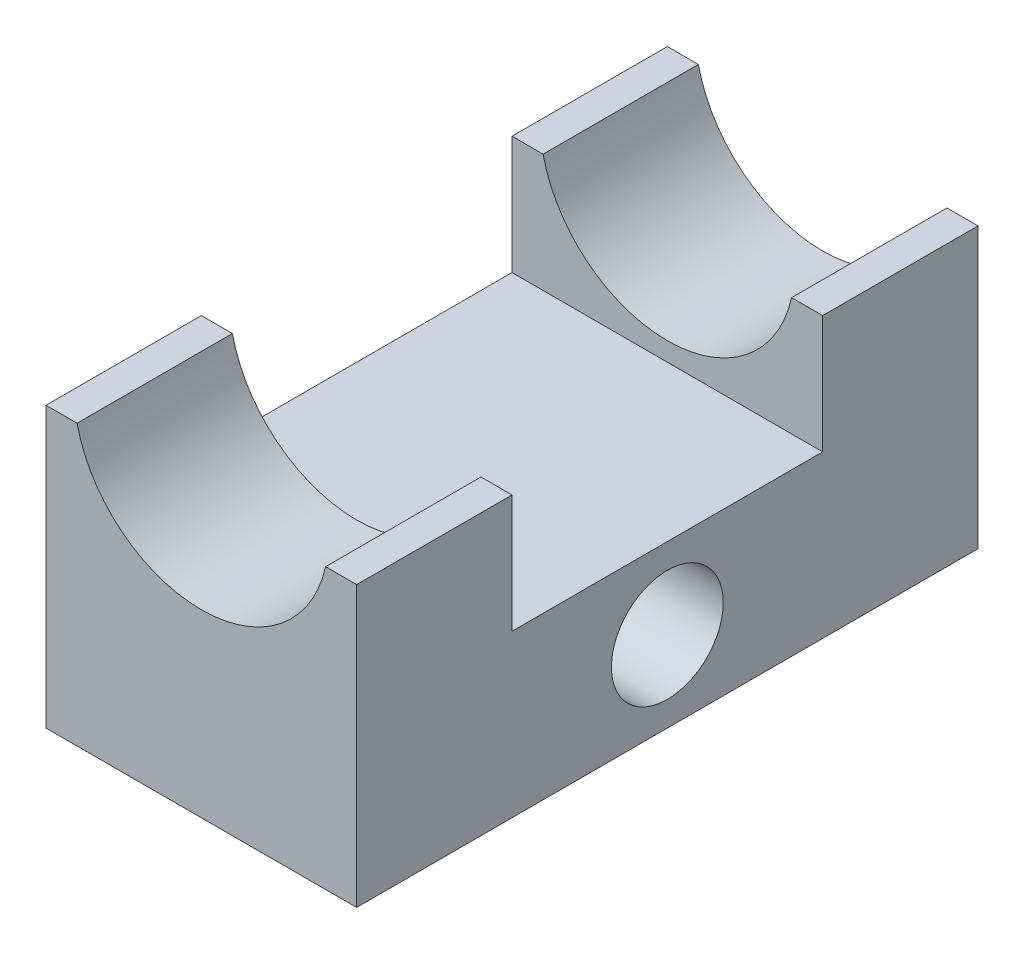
ISO-10303-21;
HEADER;
FILE_DESCRIPTION(('STEP AP214'),'2;1');
FILE_NAME('part.step','',(''),(''),'','','');
FILE_SCHEMA(('AUTOMOTIVE_DESIGN { 1 0 10303 214 1 1 1 1 }'));
ENDSEC;
DATA;
#1=APPLICATION_CONTEXT('core data for automotive mechanical design processes');
#2=APPLICATION_PROTOCOL_DEFINITION('international standard','automotive_design',2000,#1);
#3=PRODUCT_CONTEXT('',#1,'mechanical');
#4=PRODUCT('Part','Part','',(#3));
#5=PRODUCT_RELATED_PRODUCT_CATEGORY('part','',(#4));
#6=PRODUCT_DEFINITION_FORMATION('','',#4);
#7=PRODUCT_DEFINITION_CONTEXT('part definition',#1,'design');
#8=PRODUCT_DEFINITION('design','',#6,#7);
#9=PRODUCT_DEFINITION_SHAPE('','',#8);
#10=(LENGTH_UNIT() NAMED_UNIT(*) SI_UNIT(.MILLI.,.METRE.));
#11=(NAMED_UNIT(*) PLANE_ANGLE_UNIT() SI_UNIT($,.RADIAN.));
#12=(NAMED_UNIT(*) SI_UNIT($,.STERADIAN.) SOLID_ANGLE_UNIT());
#13=UNCERTAINTY_MEASURE_WITH_UNIT(LENGTH_MEASURE(1.E-05),#10,'distance_accuracy_value','');
#14=(GEOMETRIC_REPRESENTATION_CONTEXT(3) GLOBAL_UNCERTAINTY_ASSIGNED_CONTEXT((#13)) GLOBAL_UNIT_ASSIGNED_CONTEXT((#10,
#11,#12)) REPRESENTATION_CONTEXT('',''));
#15=CARTESIAN_POINT('',(0.,0.,0.));
#16=DIRECTION('',(0.,0.,1.));
#17=DIRECTION('',(1.,0.,0.));
#18=AXIS2_PLACEMENT_3D('',#15,#16,#17);
#19=CARTESIAN_POINT('',(1019.91850094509,347.847562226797,100.));
#20=DIRECTION('',(0.,0.,-1.));
#21=DIRECTION('',(-1.,0.,0.));
#22=AXIS2_PLACEMENT_3D('',#19,#20,#21);
#23=CYLINDRICAL_SURFACE('',#22,20.5);
#24=DIRECTION('',(0.,0.,-1.));
#25=VECTOR('',#24,1.);
#26=CARTESIAN_POINT('',(1039.91850094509,343.347562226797,100.));
#27=LINE('',#26,#25);
#28=CARTESIAN_POINT('',(1039.91850094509,343.347562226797,100.));
#29=VERTEX_POINT('',#28);
#30=CARTESIAN_POINT('',(1039.91850094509,343.347562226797,75.));
#31=VERTEX_POINT('',#30);
#32=EDGE_CURVE('E148',#29,#31,#27,.T.);
#33=ORIENTED_EDGE('',*,*,#32,.T.);
#34=CARTESIAN_POINT('',(1019.91850094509,347.847562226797,75.));
#35=DIRECTION('',(0.,0.,1.));
#36=DIRECTION('',(1.,0.,0.));
#37=AXIS2_PLACEMENT_3D('',#34,#35,#36);
#38=CIRCLE('',#37,20.5);
#39=CARTESIAN_POINT('',(999.918500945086,343.347562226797,75.));
#40=VERTEX_POINT('',#39);
#41=EDGE_CURVE('E202',#31,#40,#38,.F.);
#42=ORIENTED_EDGE('',*,*,#41,.T.);
#43=DIRECTION('',(0.,0.,-1.));
#44=VECTOR('',#43,1.);
#45=CARTESIAN_POINT('',(999.918500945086,343.347562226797,100.));
#46=LINE('',#45,#44);
#47=CARTESIAN_POINT('',(999.918500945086,343.347562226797,100.));
#48=VERTEX_POINT('',#47);
#49=EDGE_CURVE('E159',#48,#40,#46,.T.);
#50=ORIENTED_EDGE('',*,*,#49,.F.);
#51=CARTESIAN_POINT('',(1019.91850094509,347.847562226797,100.));
#52=DIRECTION('',(0.,0.,-1.));
#53=DIRECTION('',(1.,0.,0.));
#54=AXIS2_PLACEMENT_3D('',#51,#52,#53);
#55=CIRCLE('',#54,20.5);
#56=EDGE_CURVE('E147',#29,#48,#55,.T.);
#57=ORIENTED_EDGE('',*,*,#56,.F.);
#58=EDGE_LOOP('',(#33,#42,#50,#57));
#59=FACE_BOUND('',#58,.T.);
#60=ADVANCED_FACE('F33',(#59),#23,.F.);
#61=CARTESIAN_POINT('',(999.918500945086,343.347562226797,100.));
#62=DIRECTION('',(0.,-1.,0.));
#63=DIRECTION('',(0.,0.,-1.));
#64=AXIS2_PLACEMENT_3D('',#61,#62,#63);
#65=PLANE('',#64);
#66=ORIENTED_EDGE('',*,*,#49,.T.);
#67=DIRECTION('',(1.,0.,0.));
#68=VECTOR('',#67,1.);
#69=CARTESIAN_POINT('',(944.918500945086,343.347562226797,75.));
#70=LINE('',#69,#68);
#71=CARTESIAN_POINT('',(994.918500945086,343.347562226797,75.));
#72=VERTEX_POINT('',#71);
#73=EDGE_CURVE('E185',#72,#40,#70,.T.);
#74=ORIENTED_EDGE('',*,*,#73,.F.);
#75=DIRECTION('',(0.,0.,-1.));
#76=VECTOR('',#75,1.);
#77=CARTESIAN_POINT('',(994.918500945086,343.347562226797,100.));
#78=LINE('',#77,#76);
#79=CARTESIAN_POINT('',(994.918500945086,343.347562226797,100.));
#80=VERTEX_POINT('',#79);
#81=EDGE_CURVE('E155',#80,#72,#78,.T.);
#82=ORIENTED_EDGE('',*,*,#81,.F.);
#83=DIRECTION('',(-1.,0.,0.));
#84=VECTOR('',#83,1.);
#85=CARTESIAN_POINT('',(999.918500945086,343.347562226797,100.));
#86=LINE('',#85,#84);
#87=EDGE_CURVE('E94',#48,#80,#86,.T.);
#88=ORIENTED_EDGE('',*,*,#87,.F.);
#89=EDGE_LOOP('',(#66,#74,#82,#88));
#90=FACE_BOUND('',#89,.T.);
#91=ADVANCED_FACE('F211',(#90),#65,.F.);
#92=CARTESIAN_POINT('',(1044.91850094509,343.347562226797,100.));
#93=DIRECTION('',(0.,-1.,0.));
#94=DIRECTION('',(0.,0.,-1.));
#95=AXIS2_PLACEMENT_3D('',#92,#93,#94);
#96=PLANE('',#95);
#97=DIRECTION('',(0.,0.,-1.));
#98=VECTOR('',#97,1.);
#99=CARTESIAN_POINT('',(1044.91850094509,343.347562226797,100.));
#100=LINE('',#99,#98);
#101=CARTESIAN_POINT('',(1044.91850094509,343.347562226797,100.));
#102=VERTEX_POINT('',#101);
#103=CARTESIAN_POINT('',(1044.91850094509,343.347562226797,75.));
#104=VERTEX_POINT('',#103);
#105=EDGE_CURVE('E124',#102,#104,#100,.T.);
#106=ORIENTED_EDGE('',*,*,#105,.T.);
#107=DIRECTION('',(-1.,0.,0.));
#108=VECTOR('',#107,1.);
#109=CARTESIAN_POINT('',(1044.91850094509,343.347562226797,75.));
#110=LINE('',#109,#108);
#111=EDGE_CURVE('E11',#104,#31,#110,.T.);
#112=ORIENTED_EDGE('',*,*,#111,.T.);
#113=ORIENTED_EDGE('',*,*,#32,.F.);
#114=DIRECTION('',(-1.,0.,0.));
#115=VECTOR('',#114,1.);
#116=CARTESIAN_POINT('',(1044.91850094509,343.347562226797,100.));
#117=LINE('',#116,#115);
#118=EDGE_CURVE('E57',#102,#29,#117,.T.);
#119=ORIENTED_EDGE('',*,*,#118,.F.);
#120=EDGE_LOOP('',(#106,#112,#113,#119));
#121=FACE_BOUND('',#120,.T.);
#122=ADVANCED_FACE('F251',(#121),#96,.F.);
#123=CARTESIAN_POINT('',(999.918500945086,343.347562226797,25.));
#124=VERTEX_POINT('',#123);
#125=CARTESIAN_POINT('',(999.918500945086,343.347562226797,0.));
#126=VERTEX_POINT('',#125);
#127=EDGE_CURVE('E158',#124,#126,#46,.T.);
#128=ORIENTED_EDGE('',*,*,#127,.F.);
#129=CARTESIAN_POINT('',(1019.91850094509,347.847562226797,25.));
#130=DIRECTION('',(0.,0.,-1.));
#131=DIRECTION('',(-1.,0.,0.));
#132=AXIS2_PLACEMENT_3D('',#129,#130,#131);
#133=CIRCLE('',#132,20.5);
#134=CARTESIAN_POINT('',(1039.91850094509,343.347562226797,25.));
#135=VERTEX_POINT('',#134);
#136=EDGE_CURVE('E174',#124,#135,#133,.F.);
#137=ORIENTED_EDGE('',*,*,#136,.T.);
#138=CARTESIAN_POINT('',(1039.91850094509,343.347562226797,0.));
#139=VERTEX_POINT('',#138);
#140=EDGE_CURVE('E85',#135,#139,#27,.T.);
#141=ORIENTED_EDGE('',*,*,#140,.T.);
#142=CARTESIAN_POINT('',(1019.91850094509,347.847562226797,0.));
#143=DIRECTION('',(0.,0.,-1.));
#144=DIRECTION('',(1.,0.,0.));
#145=AXIS2_PLACEMENT_3D('',#142,#143,#144);
#146=CIRCLE('',#145,20.5);
#147=EDGE_CURVE('E134',#139,#126,#146,.T.);
#148=ORIENTED_EDGE('',*,*,#147,.T.);
#149=EDGE_LOOP('',(#128,#137,#141,#148));
#150=FACE_BOUND('',#149,.T.);
#151=ADVANCED_FACE('F35',(#150),#23,.F.);
#152=CARTESIAN_POINT('',(994.918500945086,343.347562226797,25.));
#153=VERTEX_POINT('',#152);
#154=CARTESIAN_POINT('',(994.918500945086,343.347562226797,0.));
#155=VERTEX_POINT('',#154);
#156=EDGE_CURVE('E154',#153,#155,#78,.T.);
#157=ORIENTED_EDGE('',*,*,#156,.F.);
#158=DIRECTION('',(1.,0.,0.));
#159=VECTOR('',#158,1.);
#160=CARTESIAN_POINT('',(944.918500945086,343.347562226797,25.));
#161=LINE('',#160,#159);
#162=EDGE_CURVE('E182',#153,#124,#161,.T.);
#163=ORIENTED_EDGE('',*,*,#162,.T.);
#164=ORIENTED_EDGE('',*,*,#127,.T.);
#165=DIRECTION('',(-1.,0.,0.));
#166=VECTOR('',#165,1.);
#167=CARTESIAN_POINT('',(999.918500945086,343.347562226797,0.));
#168=LINE('',#167,#166);
#169=EDGE_CURVE('E136',#126,#155,#168,.T.);
#170=ORIENTED_EDGE('',*,*,#169,.T.);
#171=EDGE_LOOP('',(#157,#163,#164,#170));
#172=FACE_BOUND('',#171,.T.);
#173=ADVANCED_FACE('F180',(#172),#65,.F.);
#174=CARTESIAN_POINT('',(994.918500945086,343.347562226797,100.));
#175=DIRECTION('',(1.,0.,0.));
#176=DIRECTION('',(0.,0.,-1.));
#177=AXIS2_PLACEMENT_3D('',#174,#175,#176);
#178=PLANE('',#177);
#179=CARTESIAN_POINT('',(994.918500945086,311.347562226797,50.));
#180=DIRECTION('',(1.,0.,0.));
#181=DIRECTION('',(0.,0.,-1.));
#182=AXIS2_PLACEMENT_3D('',#179,#180,#181);
#183=CIRCLE('',#182,9.00000000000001);
#184=CARTESIAN_POINT('',(994.918500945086,311.347562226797,41.));
#185=VERTEX_POINT('',#184);
#186=EDGE_CURVE('E232',#185,#185,#183,.T.);
#187=ORIENTED_EDGE('',*,*,#186,.T.);
#188=EDGE_LOOP('',(#187));
#189=FACE_BOUND('',#188,.T.);
#190=ORIENTED_EDGE('',*,*,#81,.T.);
#191=DIRECTION('',(0.,-1.,0.));
#192=VECTOR('',#191,1.);
#193=CARTESIAN_POINT('',(994.918500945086,343.347562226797,75.));
#194=LINE('',#193,#192);
#195=CARTESIAN_POINT('',(994.918500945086,324.347562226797,75.));
#196=VERTEX_POINT('',#195);
#197=EDGE_CURVE('E199',#72,#196,#194,.T.);
#198=ORIENTED_EDGE('',*,*,#197,.T.);
#199=DIRECTION('',(0.,0.,-1.));
#200=VECTOR('',#199,1.);
#201=CARTESIAN_POINT('',(994.918500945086,324.347562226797,100.));
#202=LINE('',#201,#200);
#203=CARTESIAN_POINT('',(994.918500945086,324.347562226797,25.));
#204=VERTEX_POINT('',#203);
#205=EDGE_CURVE('E137',#196,#204,#202,.T.);
#206=ORIENTED_EDGE('',*,*,#205,.T.);
#207=DIRECTION('',(0.,1.,0.));
#208=VECTOR('',#207,1.);
#209=CARTESIAN_POINT('',(994.918500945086,343.347562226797,25.));
#210=LINE('',#209,#208);
#211=EDGE_CURVE('E189',#204,#153,#210,.T.);
#212=ORIENTED_EDGE('',*,*,#211,.T.);
#213=ORIENTED_EDGE('',*,*,#156,.T.);
#214=DIRECTION('',(0.,-1.,0.));
#215=VECTOR('',#214,1.);
#216=CARTESIAN_POINT('',(994.918500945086,343.347562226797,0.));
#217=LINE('',#216,#215);
#218=CARTESIAN_POINT('',(994.918500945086,298.347562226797,0.));
#219=VERTEX_POINT('',#218);
#220=EDGE_CURVE('E140',#155,#219,#217,.T.);
#221=ORIENTED_EDGE('',*,*,#220,.T.);
#222=DIRECTION('',(0.,0.,-1.));
#223=VECTOR('',#222,1.);
#224=CARTESIAN_POINT('',(994.918500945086,298.347562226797,100.));
#225=LINE('',#224,#223);
#226=CARTESIAN_POINT('',(994.918500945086,298.347562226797,100.));
#227=VERTEX_POINT('',#226);
#228=EDGE_CURVE('E123',#227,#219,#225,.T.);
#229=ORIENTED_EDGE('',*,*,#228,.F.);
#230=DIRECTION('',(0.,-1.,0.));
#231=VECTOR('',#230,1.);
#232=CARTESIAN_POINT('',(994.918500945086,343.347562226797,100.));
#233=LINE('',#232,#231);
#234=EDGE_CURVE('E110',#80,#227,#233,.T.);
#235=ORIENTED_EDGE('',*,*,#234,.F.);
#236=EDGE_LOOP('',(#190,#198,#206,#212,#213,#221,#229,#235));
#237=FACE_BOUND('',#236,.T.);
#238=ADVANCED_FACE('F214',(#189,#237),#178,.F.);
#239=CARTESIAN_POINT('',(994.918500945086,298.347562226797,100.));
#240=DIRECTION('',(0.,1.,0.));
#241=DIRECTION('',(0.,0.,1.));
#242=AXIS2_PLACEMENT_3D('',#239,#240,#241);
#243=PLANE('',#242);
#244=DIRECTION('',(1.,0.,0.));
#245=VECTOR('',#244,1.);
#246=CARTESIAN_POINT('',(994.918500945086,298.347562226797,0.));
#247=LINE('',#246,#245);
#248=CARTESIAN_POINT('',(1044.91850094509,298.347562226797,0.));
#249=VERTEX_POINT('',#248);
#250=EDGE_CURVE('E119',#219,#249,#247,.T.);
#251=ORIENTED_EDGE('',*,*,#250,.T.);
#252=DIRECTION('',(0.,0.,-1.));
#253=VECTOR('',#252,1.);
#254=CARTESIAN_POINT('',(1044.91850094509,298.347562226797,100.));
#255=LINE('',#254,#253);
#256=CARTESIAN_POINT('',(1044.91850094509,298.347562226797,100.));
#257=VERTEX_POINT('',#256);
#258=EDGE_CURVE('E116',#257,#249,#255,.T.);
#259=ORIENTED_EDGE('',*,*,#258,.F.);
#260=DIRECTION('',(1.,0.,0.));
#261=VECTOR('',#260,1.);
#262=CARTESIAN_POINT('',(994.918500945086,298.347562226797,100.));
#263=LINE('',#262,#261);
#264=EDGE_CURVE('E103',#227,#257,#263,.T.);
#265=ORIENTED_EDGE('',*,*,#264,.F.);
#266=ORIENTED_EDGE('',*,*,#228,.T.);
#267=EDGE_LOOP('',(#251,#259,#265,#266));
#268=FACE_BOUND('',#267,.T.);
#269=ADVANCED_FACE('F117',(#268),#243,.F.);
#270=CARTESIAN_POINT('',(1044.91850094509,298.347562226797,100.));
#271=DIRECTION('',(-1.,0.,0.));
#272=DIRECTION('',(0.,0.,1.));
#273=AXIS2_PLACEMENT_3D('',#270,#271,#272);
#274=PLANE('',#273);
#275=CARTESIAN_POINT('',(1044.91850094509,311.347562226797,50.));
#276=DIRECTION('',(1.,0.,0.));
#277=DIRECTION('',(0.,0.,-1.));
#278=AXIS2_PLACEMENT_3D('',#275,#276,#277);
#279=CIRCLE('',#278,9.00000000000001);
#280=CARTESIAN_POINT('',(1044.91850094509,311.347562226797,41.));
#281=VERTEX_POINT('',#280);
#282=EDGE_CURVE('E237',#281,#281,#279,.T.);
#283=ORIENTED_EDGE('',*,*,#282,.F.);
#284=EDGE_LOOP('',(#283));
#285=FACE_BOUND('',#284,.T.);
#286=DIRECTION('',(0.,0.,-1.));
#287=VECTOR('',#286,1.);
#288=CARTESIAN_POINT('',(1044.91850094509,324.347562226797,75.));
#289=LINE('',#288,#287);
#290=CARTESIAN_POINT('',(1044.91850094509,324.347562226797,75.));
#291=VERTEX_POINT('',#290);
#292=CARTESIAN_POINT('',(1044.91850094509,324.347562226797,25.));
#293=VERTEX_POINT('',#292);
#294=EDGE_CURVE('E226',#291,#293,#289,.T.);
#295=ORIENTED_EDGE('',*,*,#294,.F.);
#296=DIRECTION('',(0.,-1.,0.));
#297=VECTOR('',#296,1.);
#298=CARTESIAN_POINT('',(1044.91850094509,343.347562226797,75.));
#299=LINE('',#298,#297);
#300=EDGE_CURVE('E230',#104,#291,#299,.T.);
#301=ORIENTED_EDGE('',*,*,#300,.F.);
#302=ORIENTED_EDGE('',*,*,#105,.F.);
#303=DIRECTION('',(0.,1.,0.));
#304=VECTOR('',#303,1.);
#305=CARTESIAN_POINT('',(1044.91850094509,298.347562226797,100.));
#306=LINE('',#305,#304);
#307=EDGE_CURVE('E107',#257,#102,#306,.T.);
#308=ORIENTED_EDGE('',*,*,#307,.F.);
#309=ORIENTED_EDGE('',*,*,#258,.T.);
#310=DIRECTION('',(0.,1.,0.));
#311=VECTOR('',#310,1.);
#312=CARTESIAN_POINT('',(1044.91850094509,298.347562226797,0.));
#313=LINE('',#312,#311);
#314=CARTESIAN_POINT('',(1044.91850094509,343.347562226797,0.));
#315=VERTEX_POINT('',#314);
#316=EDGE_CURVE('E143',#249,#315,#313,.T.);
#317=ORIENTED_EDGE('',*,*,#316,.T.);
#318=CARTESIAN_POINT('',(1044.91850094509,343.347562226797,25.));
#319=VERTEX_POINT('',#318);
#320=EDGE_CURVE('E151',#319,#315,#100,.T.);
#321=ORIENTED_EDGE('',*,*,#320,.F.);
#322=DIRECTION('',(0.,1.,0.));
#323=VECTOR('',#322,1.);
#324=CARTESIAN_POINT('',(1044.91850094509,343.347562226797,25.));
#325=LINE('',#324,#323);
#326=EDGE_CURVE('E48',#293,#319,#325,.T.);
#327=ORIENTED_EDGE('',*,*,#326,.F.);
#328=EDGE_LOOP('',(#295,#301,#302,#308,#309,#317,#321,#327));
#329=FACE_BOUND('',#328,.T.);
#330=ADVANCED_FACE('F127',(#285,#329),#274,.F.);
#331=ORIENTED_EDGE('',*,*,#140,.F.);
#332=DIRECTION('',(1.,0.,0.));
#333=VECTOR('',#332,1.);
#334=CARTESIAN_POINT('',(1044.91850094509,343.347562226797,25.));
#335=LINE('',#334,#333);
#336=EDGE_CURVE('E41',#135,#319,#335,.T.);
#337=ORIENTED_EDGE('',*,*,#336,.T.);
#338=ORIENTED_EDGE('',*,*,#320,.T.);
#339=DIRECTION('',(-1.,0.,0.));
#340=VECTOR('',#339,1.);
#341=CARTESIAN_POINT('',(1044.91850094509,343.347562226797,0.));
#342=LINE('',#341,#340);
#343=EDGE_CURVE('E145',#315,#139,#342,.T.);
#344=ORIENTED_EDGE('',*,*,#343,.T.);
#345=EDGE_LOOP('',(#331,#337,#338,#344));
#346=FACE_BOUND('',#345,.T.);
#347=ADVANCED_FACE('F162',(#346),#96,.F.);
#348=CARTESIAN_POINT('',(1019.91850094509,347.847562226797,100.));
#349=DIRECTION('',(0.,0.,1.));
#350=DIRECTION('',(1.,0.,0.));
#351=AXIS2_PLACEMENT_3D('',#348,#349,#350);
#352=PLANE('',#351);
#353=ORIENTED_EDGE('',*,*,#56,.T.);
#354=ORIENTED_EDGE('',*,*,#87,.T.);
#355=ORIENTED_EDGE('',*,*,#234,.T.);
#356=ORIENTED_EDGE('',*,*,#264,.T.);
#357=ORIENTED_EDGE('',*,*,#307,.T.);
#358=ORIENTED_EDGE('',*,*,#118,.T.);
#359=EDGE_LOOP('',(#353,#354,#355,#356,#357,#358));
#360=FACE_BOUND('',#359,.T.);
#361=ADVANCED_FACE('F105',(#360),#352,.T.);
#362=CARTESIAN_POINT('',(1019.91850094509,347.847562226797,0.));
#363=DIRECTION('',(0.,0.,1.));
#364=DIRECTION('',(1.,0.,0.));
#365=AXIS2_PLACEMENT_3D('',#362,#363,#364);
#366=PLANE('',#365);
#367=ORIENTED_EDGE('',*,*,#147,.F.);
#368=ORIENTED_EDGE('',*,*,#343,.F.);
#369=ORIENTED_EDGE('',*,*,#316,.F.);
#370=ORIENTED_EDGE('',*,*,#250,.F.);
#371=ORIENTED_EDGE('',*,*,#220,.F.);
#372=ORIENTED_EDGE('',*,*,#169,.F.);
#373=EDGE_LOOP('',(#367,#368,#369,#370,#371,#372));
#374=FACE_BOUND('',#373,.T.);
#375=ADVANCED_FACE('F169',(#374),#366,.F.);
#376=CARTESIAN_POINT('',(944.918500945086,324.347562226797,75.));
#377=DIRECTION('',(0.,-1.,0.));
#378=DIRECTION('',(0.,0.,-1.));
#379=AXIS2_PLACEMENT_3D('',#376,#377,#378);
#380=PLANE('',#379);
#381=DIRECTION('',(1.,0.,0.));
#382=VECTOR('',#381,1.);
#383=CARTESIAN_POINT('',(944.918500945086,324.347562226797,75.));
#384=LINE('',#383,#382);
#385=EDGE_CURVE('E191',#196,#291,#384,.T.);
#386=ORIENTED_EDGE('',*,*,#385,.T.);
#387=ORIENTED_EDGE('',*,*,#294,.T.);
#388=DIRECTION('',(1.,0.,0.));
#389=VECTOR('',#388,1.);
#390=CARTESIAN_POINT('',(944.918500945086,324.347562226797,25.));
#391=LINE('',#390,#389);
#392=EDGE_CURVE('E186',#204,#293,#391,.T.);
#393=ORIENTED_EDGE('',*,*,#392,.F.);
#394=ORIENTED_EDGE('',*,*,#205,.F.);
#395=EDGE_LOOP('',(#386,#387,#393,#394));
#396=FACE_BOUND('',#395,.T.);
#397=ADVANCED_FACE('F224',(#396),#380,.F.);
#398=CARTESIAN_POINT('',(944.918500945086,343.347562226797,75.));
#399=DIRECTION('',(0.,0.,1.));
#400=DIRECTION('',(1.,0.,0.));
#401=AXIS2_PLACEMENT_3D('',#398,#399,#400);
#402=PLANE('',#401);
#403=ORIENTED_EDGE('',*,*,#111,.F.);
#404=ORIENTED_EDGE('',*,*,#300,.T.);
#405=ORIENTED_EDGE('',*,*,#385,.F.);
#406=ORIENTED_EDGE('',*,*,#197,.F.);
#407=ORIENTED_EDGE('',*,*,#73,.T.);
#408=ORIENTED_EDGE('',*,*,#41,.F.);
#409=EDGE_LOOP('',(#403,#404,#405,#406,#407,#408));
#410=FACE_BOUND('',#409,.T.);
#411=ADVANCED_FACE('F271',(#410),#402,.F.);
#412=CARTESIAN_POINT('',(944.918500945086,343.347562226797,25.));
#413=DIRECTION('',(0.,0.,-1.));
#414=DIRECTION('',(-1.,0.,0.));
#415=AXIS2_PLACEMENT_3D('',#412,#413,#414);
#416=PLANE('',#415);
#417=ORIENTED_EDGE('',*,*,#162,.F.);
#418=ORIENTED_EDGE('',*,*,#211,.F.);
#419=ORIENTED_EDGE('',*,*,#392,.T.);
#420=ORIENTED_EDGE('',*,*,#326,.T.);
#421=ORIENTED_EDGE('',*,*,#336,.F.);
#422=ORIENTED_EDGE('',*,*,#136,.F.);
#423=EDGE_LOOP('',(#417,#418,#419,#420,#421,#422));
#424=FACE_BOUND('',#423,.T.);
#425=ADVANCED_FACE('F219',(#424),#416,.F.);
#426=CARTESIAN_POINT('',(944.918500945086,311.347562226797,50.));
#427=DIRECTION('',(1.,0.,0.));
#428=DIRECTION('',(0.,0.,-1.));
#429=AXIS2_PLACEMENT_3D('',#426,#427,#428);
#430=CYLINDRICAL_SURFACE('',#429,9.00000000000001);
#431=ORIENTED_EDGE('',*,*,#282,.T.);
#432=EDGE_LOOP('',(#431));
#433=FACE_BOUND('',#432,.T.);
#434=ORIENTED_EDGE('',*,*,#186,.F.);
#435=EDGE_LOOP('',(#434));
#436=FACE_BOUND('',#435,.T.);
#437=ADVANCED_FACE('F241',(#433,#436),#430,.F.);
#438=CLOSED_SHELL('',(#60,#91,#122,#151,#173,#238,#269,#330,#347,#361,#375,#397,#411,#425,#437));
#439=MANIFOLD_SOLID_BREP('B2',#438);
#440=ADVANCED_BREP_SHAPE_REPRESENTATION('',(#18,#439),#14);
#441=SHAPE_DEFINITION_REPRESENTATION(#9,#440);
ENDSEC;
END-ISO-10303-21;
